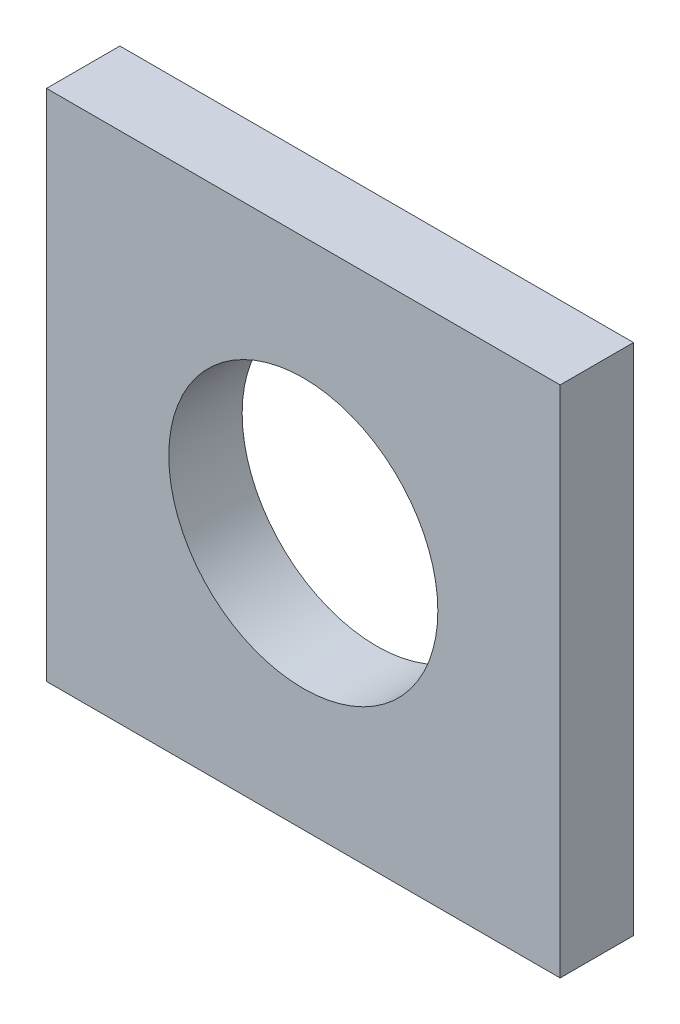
ISO-10303-21;
HEADER;
FILE_DESCRIPTION(('STEP AP214'),'2;1');
FILE_NAME('part.step','',(''),(''),'','','');
FILE_SCHEMA(('AUTOMOTIVE_DESIGN { 1 0 10303 214 1 1 1 1 }'));
ENDSEC;
DATA;
#1=APPLICATION_CONTEXT('core data for automotive mechanical design processes');
#2=APPLICATION_PROTOCOL_DEFINITION('international standard','automotive_design',2000,#1);
#3=PRODUCT_CONTEXT('',#1,'mechanical');
#4=PRODUCT('Part','Part','',(#3));
#5=PRODUCT_RELATED_PRODUCT_CATEGORY('part','',(#4));
#6=PRODUCT_DEFINITION_FORMATION('','',#4);
#7=PRODUCT_DEFINITION_CONTEXT('part definition',#1,'design');
#8=PRODUCT_DEFINITION('design','',#6,#7);
#9=PRODUCT_DEFINITION_SHAPE('','',#8);
#10=(LENGTH_UNIT() NAMED_UNIT(*) SI_UNIT(.MILLI.,.METRE.));
#11=(NAMED_UNIT(*) PLANE_ANGLE_UNIT() SI_UNIT($,.RADIAN.));
#12=(NAMED_UNIT(*) SI_UNIT($,.STERADIAN.) SOLID_ANGLE_UNIT());
#13=UNCERTAINTY_MEASURE_WITH_UNIT(LENGTH_MEASURE(1.E-05),#10,'distance_accuracy_value','');
#14=(GEOMETRIC_REPRESENTATION_CONTEXT(3) GLOBAL_UNCERTAINTY_ASSIGNED_CONTEXT((#13)) GLOBAL_UNIT_ASSIGNED_CONTEXT((#10,
#11,#12)) REPRESENTATION_CONTEXT('',''));
#15=CARTESIAN_POINT('',(0.,0.,0.));
#16=DIRECTION('',(0.,0.,1.));
#17=DIRECTION('',(1.,0.,0.));
#18=AXIS2_PLACEMENT_3D('',#15,#16,#17);
#19=CARTESIAN_POINT('',(0.,0.,6.));
#20=DIRECTION('',(0.,0.,1.));
#21=DIRECTION('',(1.,0.,0.));
#22=AXIS2_PLACEMENT_3D('',#19,#20,#21);
#23=PLANE('',#22);
#24=DIRECTION('',(0.,1.,0.));
#25=VECTOR('',#24,1.);
#26=CARTESIAN_POINT('',(-11.5952065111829,36.2314533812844,6.));
#27=LINE('',#26,#25);
#28=CARTESIAN_POINT('',(-11.5952065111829,-5.76854661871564,6.));
#29=VERTEX_POINT('',#28);
#30=CARTESIAN_POINT('',(-11.5952065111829,36.2314533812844,6.));
#31=VERTEX_POINT('',#30);
#32=EDGE_CURVE('E85',#29,#31,#27,.T.);
#33=ORIENTED_EDGE('',*,*,#32,.T.);
#34=DIRECTION('',(-1.,0.,0.));
#35=VECTOR('',#34,1.);
#36=CARTESIAN_POINT('',(-53.5952065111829,36.2314533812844,6.));
#37=LINE('',#36,#35);
#38=CARTESIAN_POINT('',(-53.5952065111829,36.2314533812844,6.));
#39=VERTEX_POINT('',#38);
#40=EDGE_CURVE('E80',#31,#39,#37,.T.);
#41=ORIENTED_EDGE('',*,*,#40,.T.);
#42=DIRECTION('',(0.,-1.,0.));
#43=VECTOR('',#42,1.);
#44=CARTESIAN_POINT('',(-53.5952065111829,36.2314533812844,6.));
#45=LINE('',#44,#43);
#46=CARTESIAN_POINT('',(-53.5952065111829,-5.76854661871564,6.));
#47=VERTEX_POINT('',#46);
#48=EDGE_CURVE('E83',#39,#47,#45,.T.);
#49=ORIENTED_EDGE('',*,*,#48,.T.);
#50=DIRECTION('',(1.,0.,0.));
#51=VECTOR('',#50,1.);
#52=CARTESIAN_POINT('',(-53.5952065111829,-5.76854661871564,6.));
#53=LINE('',#52,#51);
#54=EDGE_CURVE('E50',#47,#29,#53,.T.);
#55=ORIENTED_EDGE('',*,*,#54,.T.);
#56=EDGE_LOOP('',(#33,#41,#49,#55));
#57=FACE_BOUND('',#56,.T.);
#58=CARTESIAN_POINT('',(-32.5952065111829,15.2314533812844,6.));
#59=DIRECTION('',(0.,0.,1.));
#60=DIRECTION('',(1.,0.,0.));
#61=AXIS2_PLACEMENT_3D('',#58,#59,#60);
#62=CIRCLE('',#61,11.);
#63=CARTESIAN_POINT('',(-21.5952065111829,15.2314533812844,6.));
#64=VERTEX_POINT('',#63);
#65=EDGE_CURVE('E100',#64,#64,#62,.T.);
#66=ORIENTED_EDGE('',*,*,#65,.F.);
#67=EDGE_LOOP('',(#66));
#68=FACE_BOUND('',#67,.T.);
#69=ADVANCED_FACE('F33',(#57,#68),#23,.T.);
#70=CARTESIAN_POINT('',(0.,0.,0.));
#71=DIRECTION('',(0.,0.,1.));
#72=DIRECTION('',(1.,0.,0.));
#73=AXIS2_PLACEMENT_3D('',#70,#71,#72);
#74=PLANE('',#73);
#75=DIRECTION('',(0.,1.,0.));
#76=VECTOR('',#75,1.);
#77=CARTESIAN_POINT('',(-11.5952065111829,36.2314533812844,0.));
#78=LINE('',#77,#76);
#79=CARTESIAN_POINT('',(-11.5952065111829,-5.76854661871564,0.));
#80=VERTEX_POINT('',#79);
#81=CARTESIAN_POINT('',(-11.5952065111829,36.2314533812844,0.));
#82=VERTEX_POINT('',#81);
#83=EDGE_CURVE('E97',#80,#82,#78,.T.);
#84=ORIENTED_EDGE('',*,*,#83,.F.);
#85=DIRECTION('',(1.,0.,0.));
#86=VECTOR('',#85,1.);
#87=CARTESIAN_POINT('',(-53.5952065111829,-5.76854661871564,0.));
#88=LINE('',#87,#86);
#89=CARTESIAN_POINT('',(-53.5952065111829,-5.76854661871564,0.));
#90=VERTEX_POINT('',#89);
#91=EDGE_CURVE('E73',#90,#80,#88,.T.);
#92=ORIENTED_EDGE('',*,*,#91,.F.);
#93=DIRECTION('',(0.,-1.,0.));
#94=VECTOR('',#93,1.);
#95=CARTESIAN_POINT('',(-53.5952065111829,36.2314533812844,0.));
#96=LINE('',#95,#94);
#97=CARTESIAN_POINT('',(-53.5952065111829,36.2314533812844,0.));
#98=VERTEX_POINT('',#97);
#99=EDGE_CURVE('E67',#98,#90,#96,.T.);
#100=ORIENTED_EDGE('',*,*,#99,.F.);
#101=DIRECTION('',(-1.,0.,0.));
#102=VECTOR('',#101,1.);
#103=CARTESIAN_POINT('',(-53.5952065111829,36.2314533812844,0.));
#104=LINE('',#103,#102);
#105=EDGE_CURVE('E89',#82,#98,#104,.T.);
#106=ORIENTED_EDGE('',*,*,#105,.F.);
#107=EDGE_LOOP('',(#84,#92,#100,#106));
#108=FACE_BOUND('',#107,.T.);
#109=CARTESIAN_POINT('',(-32.5952065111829,15.2314533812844,0.));
#110=DIRECTION('',(0.,0.,1.));
#111=DIRECTION('',(1.,0.,0.));
#112=AXIS2_PLACEMENT_3D('',#109,#110,#111);
#113=CIRCLE('',#112,11.);
#114=CARTESIAN_POINT('',(-21.5952065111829,15.2314533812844,0.));
#115=VERTEX_POINT('',#114);
#116=EDGE_CURVE('E112',#115,#115,#113,.T.);
#117=ORIENTED_EDGE('',*,*,#116,.T.);
#118=EDGE_LOOP('',(#117));
#119=FACE_BOUND('',#118,.T.);
#120=ADVANCED_FACE('F108',(#108,#119),#74,.F.);
#121=CARTESIAN_POINT('',(-11.5952065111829,36.2314533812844,6.));
#122=DIRECTION('',(-1.,0.,0.));
#123=DIRECTION('',(0.,-1.,0.));
#124=AXIS2_PLACEMENT_3D('',#121,#122,#123);
#125=PLANE('',#124);
#126=ORIENTED_EDGE('',*,*,#83,.T.);
#127=DIRECTION('',(0.,0.,-1.));
#128=VECTOR('',#127,1.);
#129=CARTESIAN_POINT('',(-11.5952065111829,36.2314533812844,6.));
#130=LINE('',#129,#128);
#131=EDGE_CURVE('E11',#31,#82,#130,.T.);
#132=ORIENTED_EDGE('',*,*,#131,.F.);
#133=ORIENTED_EDGE('',*,*,#32,.F.);
#134=DIRECTION('',(0.,0.,-1.));
#135=VECTOR('',#134,1.);
#136=CARTESIAN_POINT('',(-11.5952065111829,-5.76854661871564,6.));
#137=LINE('',#136,#135);
#138=EDGE_CURVE('E93',#29,#80,#137,.T.);
#139=ORIENTED_EDGE('',*,*,#138,.T.);
#140=EDGE_LOOP('',(#126,#132,#133,#139));
#141=FACE_BOUND('',#140,.T.);
#142=ADVANCED_FACE('F35',(#141),#125,.F.);
#143=CARTESIAN_POINT('',(-53.5952065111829,36.2314533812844,6.));
#144=DIRECTION('',(0.,-1.,0.));
#145=DIRECTION('',(0.,0.,-1.));
#146=AXIS2_PLACEMENT_3D('',#143,#144,#145);
#147=PLANE('',#146);
#148=ORIENTED_EDGE('',*,*,#105,.T.);
#149=DIRECTION('',(0.,0.,-1.));
#150=VECTOR('',#149,1.);
#151=CARTESIAN_POINT('',(-53.5952065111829,36.2314533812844,6.));
#152=LINE('',#151,#150);
#153=EDGE_CURVE('E42',#39,#98,#152,.T.);
#154=ORIENTED_EDGE('',*,*,#153,.F.);
#155=ORIENTED_EDGE('',*,*,#40,.F.);
#156=ORIENTED_EDGE('',*,*,#131,.T.);
#157=EDGE_LOOP('',(#148,#154,#155,#156));
#158=FACE_BOUND('',#157,.T.);
#159=ADVANCED_FACE('F88',(#158),#147,.F.);
#160=CARTESIAN_POINT('',(-53.5952065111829,36.2314533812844,6.));
#161=DIRECTION('',(1.,0.,0.));
#162=DIRECTION('',(0.,1.,0.));
#163=AXIS2_PLACEMENT_3D('',#160,#161,#162);
#164=PLANE('',#163);
#165=ORIENTED_EDGE('',*,*,#99,.T.);
#166=DIRECTION('',(0.,0.,-1.));
#167=VECTOR('',#166,1.);
#168=CARTESIAN_POINT('',(-53.5952065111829,-5.76854661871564,6.));
#169=LINE('',#168,#167);
#170=EDGE_CURVE('E90',#47,#90,#169,.T.);
#171=ORIENTED_EDGE('',*,*,#170,.F.);
#172=ORIENTED_EDGE('',*,*,#48,.F.);
#173=ORIENTED_EDGE('',*,*,#153,.T.);
#174=EDGE_LOOP('',(#165,#171,#172,#173));
#175=FACE_BOUND('',#174,.T.);
#176=ADVANCED_FACE('F91',(#175),#164,.F.);
#177=CARTESIAN_POINT('',(-53.5952065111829,-5.76854661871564,6.));
#178=DIRECTION('',(0.,1.,0.));
#179=DIRECTION('',(0.,0.,1.));
#180=AXIS2_PLACEMENT_3D('',#177,#178,#179);
#181=PLANE('',#180);
#182=ORIENTED_EDGE('',*,*,#91,.T.);
#183=ORIENTED_EDGE('',*,*,#138,.F.);
#184=ORIENTED_EDGE('',*,*,#54,.F.);
#185=ORIENTED_EDGE('',*,*,#170,.T.);
#186=EDGE_LOOP('',(#182,#183,#184,#185));
#187=FACE_BOUND('',#186,.T.);
#188=ADVANCED_FACE('F105',(#187),#181,.F.);
#189=CARTESIAN_POINT('',(-32.5952065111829,15.2314533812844,6.));
#190=DIRECTION('',(0.,0.,-1.));
#191=DIRECTION('',(-1.,0.,0.));
#192=AXIS2_PLACEMENT_3D('',#189,#190,#191);
#193=CYLINDRICAL_SURFACE('',#192,11.);
#194=ORIENTED_EDGE('',*,*,#65,.T.);
#195=EDGE_LOOP('',(#194));
#196=FACE_BOUND('',#195,.T.);
#197=ORIENTED_EDGE('',*,*,#116,.F.);
#198=EDGE_LOOP('',(#197));
#199=FACE_BOUND('',#198,.T.);
#200=ADVANCED_FACE('F118',(#196,#199),#193,.F.);
#201=CLOSED_SHELL('',(#69,#120,#142,#159,#176,#188,#200));
#202=MANIFOLD_SOLID_BREP('B2',#201);
#203=ADVANCED_BREP_SHAPE_REPRESENTATION('',(#18,#202),#14);
#204=SHAPE_DEFINITION_REPRESENTATION(#9,#203);
ENDSEC;
END-ISO-10303-21;
